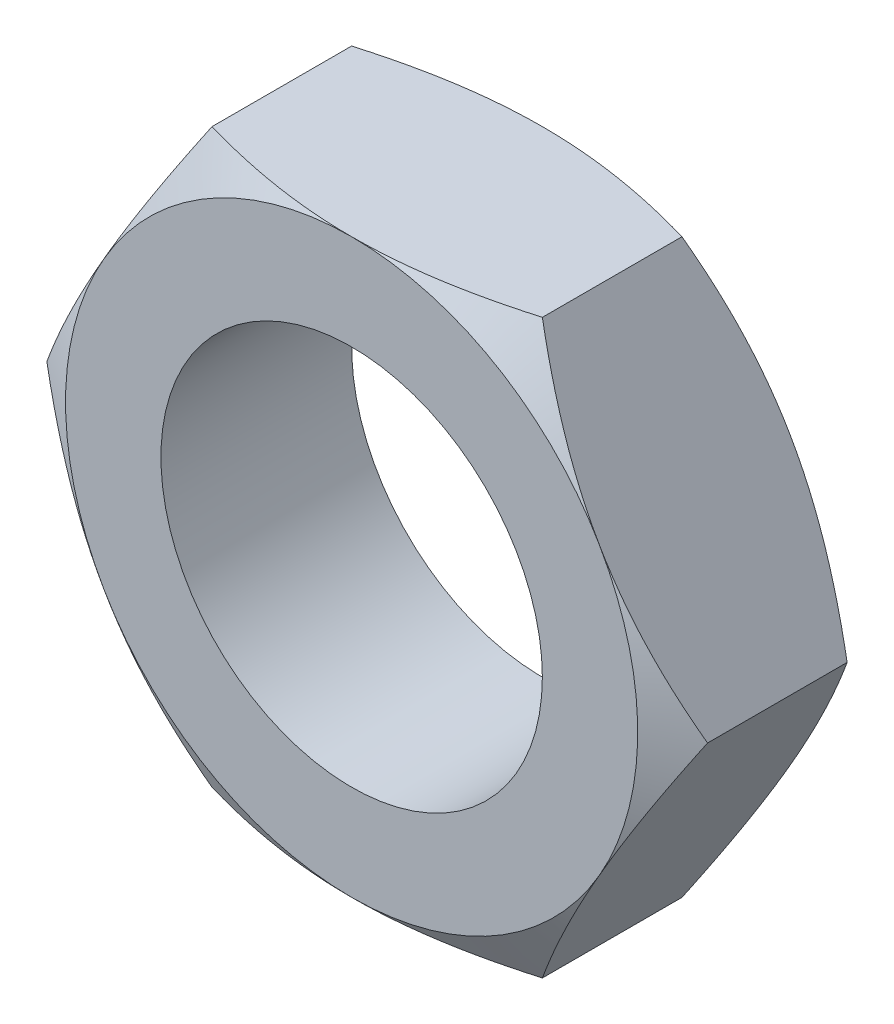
from build123d import *

# Parameters (mm, degrees)
SKETCH1_R      = 10
EXTRUDE1_DEPTH = 5


with BuildPart() as part:
    # Sketch1 → Extrude1 (new, symmetric)
    with BuildSketch(Plane.XY):
        Polygon((8.660254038, 15), (-8.660254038, 15), (-17.320508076, 0), (-8.660254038, -15), (8.660254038, -15), (17.320508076, 0), align=None)
        Circle(SKETCH1_R, mode=Mode.SUBTRACT)
    extrude(amount=EXTRUDE1_DEPTH, both=True)

    # Sketch2 → Cut-Revolve1 (revolve, cut)
    with BuildSketch(Plane(origin=(0, 0, 0), x_dir=(0, 0, -1), z_dir=(1, 0, 0))):
        Polygon((-5, 15), (-5, 30), (3.660254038, 30), align=None)
    cut_revolve1 = revolve(axis=Axis((0, 0, 5), (0, 0, -1)), mode=Mode.SUBTRACT)

    # Mirror1: Cut-Revolve1 across plane
    add(cut_revolve1.mirror(Plane.XY), mode=Mode.SUBTRACT)


solid = part.part
